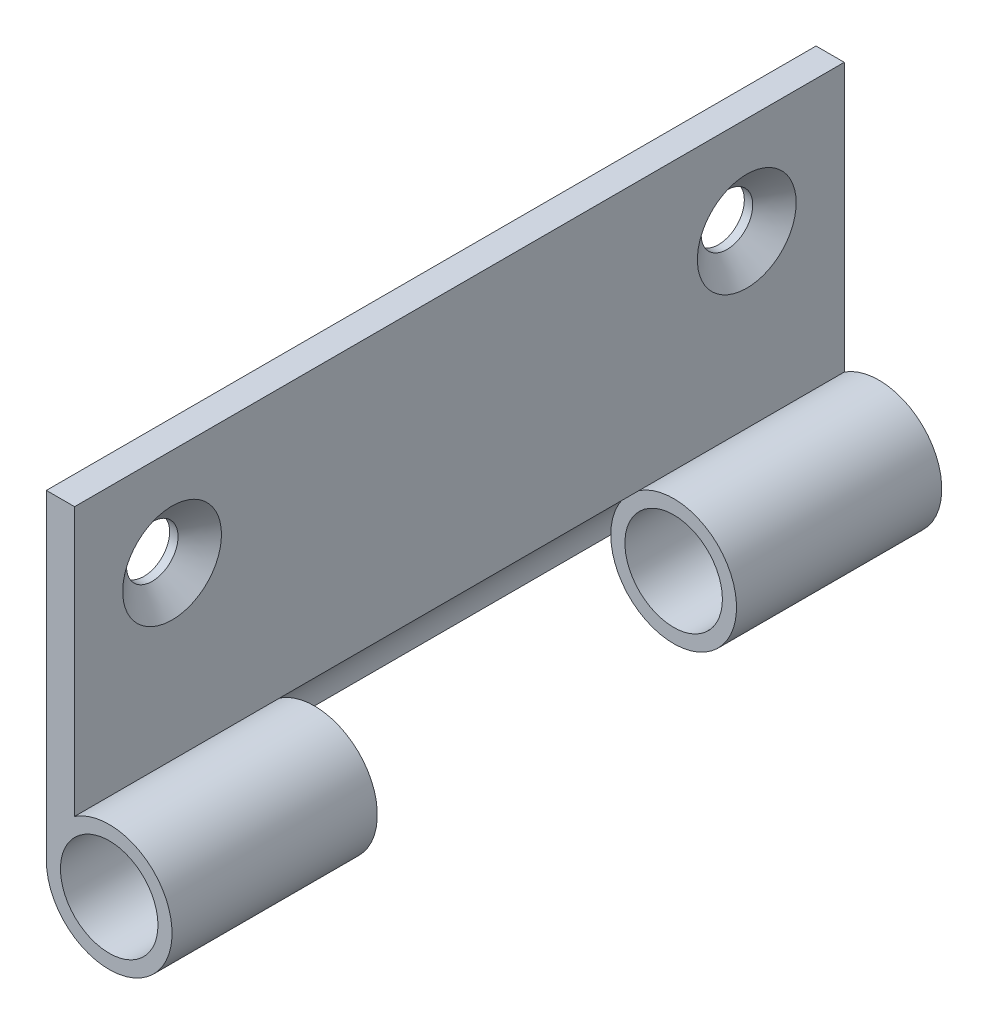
ISO-10303-21;
HEADER;
FILE_DESCRIPTION(('STEP AP214'),'2;1');
FILE_NAME('part.step','',(''),(''),'','','');
FILE_SCHEMA(('AUTOMOTIVE_DESIGN { 1 0 10303 214 1 1 1 1 }'));
ENDSEC;
DATA;
#1=APPLICATION_CONTEXT('core data for automotive mechanical design processes');
#2=APPLICATION_PROTOCOL_DEFINITION('international standard','automotive_design',2000,#1);
#3=PRODUCT_CONTEXT('',#1,'mechanical');
#4=PRODUCT('Part','Part','',(#3));
#5=PRODUCT_RELATED_PRODUCT_CATEGORY('part','',(#4));
#6=PRODUCT_DEFINITION_FORMATION('','',#4);
#7=PRODUCT_DEFINITION_CONTEXT('part definition',#1,'design');
#8=PRODUCT_DEFINITION('design','',#6,#7);
#9=PRODUCT_DEFINITION_SHAPE('','',#8);
#10=(LENGTH_UNIT() NAMED_UNIT(*) SI_UNIT(.MILLI.,.METRE.));
#11=(NAMED_UNIT(*) PLANE_ANGLE_UNIT() SI_UNIT($,.RADIAN.));
#12=(NAMED_UNIT(*) SI_UNIT($,.STERADIAN.) SOLID_ANGLE_UNIT());
#13=UNCERTAINTY_MEASURE_WITH_UNIT(LENGTH_MEASURE(1.E-05),#10,'distance_accuracy_value','');
#14=(GEOMETRIC_REPRESENTATION_CONTEXT(3) GLOBAL_UNCERTAINTY_ASSIGNED_CONTEXT((#13)) GLOBAL_UNIT_ASSIGNED_CONTEXT((#10,
#11,#12)) REPRESENTATION_CONTEXT('',''));
#15=CARTESIAN_POINT('',(0.,0.,0.));
#16=DIRECTION('',(0.,0.,1.));
#17=DIRECTION('',(1.,0.,0.));
#18=AXIS2_PLACEMENT_3D('',#15,#16,#17);
#19=CARTESIAN_POINT('',(6.223,0.,-55.7013019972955));
#20=DIRECTION('',(0.,0.,1.));
#21=DIRECTION('',(1.,0.,0.));
#22=AXIS2_PLACEMENT_3D('',#19,#20,#21);
#23=CYLINDRICAL_SURFACE('',#22,6.223);
#24=DIRECTION('',(0.,0.,1.));
#25=VECTOR('',#24,1.);
#26=CARTESIAN_POINT('',(2.794,5.19304226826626,-55.7013019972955));
#27=LINE('',#26,#25);
#28=CARTESIAN_POINT('',(2.794,5.19304226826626,-17.78));
#29=VERTEX_POINT('',#28);
#30=CARTESIAN_POINT('',(2.794,5.19304226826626,-38.1));
#31=VERTEX_POINT('',#30);
#32=EDGE_CURVE('E64',#29,#31,#27,.F.);
#33=ORIENTED_EDGE('',*,*,#32,.F.);
#34=CARTESIAN_POINT('',(6.223,0.,-17.78));
#35=DIRECTION('',(0.,0.,1.));
#36=DIRECTION('',(1.,0.,0.));
#37=AXIS2_PLACEMENT_3D('',#34,#35,#36);
#38=CIRCLE('',#37,6.223);
#39=CARTESIAN_POINT('',(0.,0.,-17.78));
#40=VERTEX_POINT('',#39);
#41=EDGE_CURVE('E110',#40,#29,#38,.T.);
#42=ORIENTED_EDGE('',*,*,#41,.F.);
#43=DIRECTION('',(0.,0.,-1.));
#44=VECTOR('',#43,1.);
#45=CARTESIAN_POINT('',(0.,0.,38.1));
#46=LINE('',#45,#44);
#47=CARTESIAN_POINT('',(0.,0.,-38.1));
#48=VERTEX_POINT('',#47);
#49=EDGE_CURVE('E120',#40,#48,#46,.T.);
#50=ORIENTED_EDGE('',*,*,#49,.T.);
#51=CARTESIAN_POINT('',(6.223,0.,-38.1));
#52=DIRECTION('',(0.,0.,-1.));
#53=DIRECTION('',(0.,1.,0.));
#54=AXIS2_PLACEMENT_3D('',#51,#52,#53);
#55=CIRCLE('',#54,6.223);
#56=EDGE_CURVE('E147',#48,#31,#55,.F.);
#57=ORIENTED_EDGE('',*,*,#56,.T.);
#58=EDGE_LOOP('',(#33,#42,#50,#57));
#59=FACE_BOUND('',#58,.T.);
#60=ADVANCED_FACE('F40',(#59),#23,.T.);
#61=CARTESIAN_POINT('',(6.223,0.,-38.1));
#62=DIRECTION('',(0.,0.,1.));
#63=DIRECTION('',(1.,0.,0.));
#64=AXIS2_PLACEMENT_3D('',#61,#62,#63);
#65=CYLINDRICAL_SURFACE('',#64,4.826);
#66=CARTESIAN_POINT('',(6.223,0.,-38.1));
#67=DIRECTION('',(0.,0.,1.));
#68=DIRECTION('',(1.,0.,0.));
#69=AXIS2_PLACEMENT_3D('',#66,#67,#68);
#70=CIRCLE('',#69,4.826);
#71=CARTESIAN_POINT('',(11.049,0.,-38.1));
#72=VERTEX_POINT('',#71);
#73=EDGE_CURVE('E150',#72,#72,#70,.T.);
#74=ORIENTED_EDGE('',*,*,#73,.F.);
#75=EDGE_LOOP('',(#74));
#76=FACE_BOUND('',#75,.T.);
#77=CARTESIAN_POINT('',(6.223,0.,-17.78));
#78=DIRECTION('',(0.,0.,1.));
#79=DIRECTION('',(1.,0.,0.));
#80=AXIS2_PLACEMENT_3D('',#77,#78,#79);
#81=CIRCLE('',#80,4.826);
#82=CARTESIAN_POINT('',(11.049,0.,-17.78));
#83=VERTEX_POINT('',#82);
#84=EDGE_CURVE('E44',#83,#83,#81,.F.);
#85=ORIENTED_EDGE('',*,*,#84,.F.);
#86=EDGE_LOOP('',(#85));
#87=FACE_BOUND('',#86,.T.);
#88=ADVANCED_FACE('F217',(#76,#87),#65,.F.);
#89=CARTESIAN_POINT('',(2.794,31.75,38.1));
#90=DIRECTION('',(0.,1.,0.));
#91=DIRECTION('',(0.,0.,1.));
#92=AXIS2_PLACEMENT_3D('',#89,#90,#91);
#93=PLANE('',#92);
#94=DIRECTION('',(0.,0.,-1.));
#95=VECTOR('',#94,1.);
#96=CARTESIAN_POINT('',(0.,31.75,38.1));
#97=LINE('',#96,#95);
#98=CARTESIAN_POINT('',(0.,31.75,38.1));
#99=VERTEX_POINT('',#98);
#100=CARTESIAN_POINT('',(0.,31.75,-38.1));
#101=VERTEX_POINT('',#100);
#102=EDGE_CURVE('E133',#99,#101,#97,.T.);
#103=ORIENTED_EDGE('',*,*,#102,.F.);
#104=DIRECTION('',(-1.,0.,0.));
#105=VECTOR('',#104,1.);
#106=CARTESIAN_POINT('',(2.794,31.75,38.1));
#107=LINE('',#106,#105);
#108=CARTESIAN_POINT('',(2.794,31.75,38.1));
#109=VERTEX_POINT('',#108);
#110=EDGE_CURVE('E12',#109,#99,#107,.T.);
#111=ORIENTED_EDGE('',*,*,#110,.F.);
#112=DIRECTION('',(0.,0.,-1.));
#113=VECTOR('',#112,1.);
#114=CARTESIAN_POINT('',(2.794,31.75,38.1));
#115=LINE('',#114,#113);
#116=CARTESIAN_POINT('',(2.794,31.75,-38.1));
#117=VERTEX_POINT('',#116);
#118=EDGE_CURVE('E126',#109,#117,#115,.T.);
#119=ORIENTED_EDGE('',*,*,#118,.T.);
#120=DIRECTION('',(-1.,0.,0.));
#121=VECTOR('',#120,1.);
#122=CARTESIAN_POINT('',(2.794,31.75,-38.1));
#123=LINE('',#122,#121);
#124=EDGE_CURVE('E49',#117,#101,#123,.T.);
#125=ORIENTED_EDGE('',*,*,#124,.T.);
#126=EDGE_LOOP('',(#103,#111,#119,#125));
#127=FACE_BOUND('',#126,.T.);
#128=ADVANCED_FACE('F42',(#127),#93,.T.);
#129=CARTESIAN_POINT('',(2.794,31.75,38.1));
#130=DIRECTION('',(0.,0.,-1.));
#131=DIRECTION('',(0.,1.,0.));
#132=AXIS2_PLACEMENT_3D('',#129,#130,#131);
#133=PLANE('',#132);
#134=CARTESIAN_POINT('',(6.223,0.,38.1));
#135=DIRECTION('',(0.,0.,1.));
#136=DIRECTION('',(1.,0.,0.));
#137=AXIS2_PLACEMENT_3D('',#134,#135,#136);
#138=CIRCLE('',#137,4.826);
#139=CARTESIAN_POINT('',(11.049,0.,38.1));
#140=VERTEX_POINT('',#139);
#141=EDGE_CURVE('E151',#140,#140,#138,.T.);
#142=ORIENTED_EDGE('',*,*,#141,.F.);
#143=EDGE_LOOP('',(#142));
#144=FACE_BOUND('',#143,.T.);
#145=DIRECTION('',(0.,-1.,0.));
#146=VECTOR('',#145,1.);
#147=CARTESIAN_POINT('',(0.,31.75,38.1));
#148=LINE('',#147,#146);
#149=CARTESIAN_POINT('',(0.,0.,38.1));
#150=VERTEX_POINT('',#149);
#151=EDGE_CURVE('E125',#99,#150,#148,.T.);
#152=ORIENTED_EDGE('',*,*,#151,.T.);
#153=CARTESIAN_POINT('',(6.223,0.,38.1));
#154=DIRECTION('',(0.,0.,1.));
#155=DIRECTION('',(1.,0.,0.));
#156=AXIS2_PLACEMENT_3D('',#153,#154,#155);
#157=CIRCLE('',#156,6.223);
#158=CARTESIAN_POINT('',(2.794,5.19304226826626,38.1));
#159=VERTEX_POINT('',#158);
#160=EDGE_CURVE('E124',#150,#159,#157,.T.);
#161=ORIENTED_EDGE('',*,*,#160,.T.);
#162=DIRECTION('',(0.,-1.,0.));
#163=VECTOR('',#162,1.);
#164=CARTESIAN_POINT('',(2.794,31.75,38.1));
#165=LINE('',#164,#163);
#166=EDGE_CURVE('E140',#109,#159,#165,.T.);
#167=ORIENTED_EDGE('',*,*,#166,.F.);
#168=ORIENTED_EDGE('',*,*,#110,.T.);
#169=EDGE_LOOP('',(#152,#161,#167,#168));
#170=FACE_BOUND('',#169,.T.);
#171=ADVANCED_FACE('F188',(#144,#170),#133,.F.);
#172=CARTESIAN_POINT('',(2.794,31.75,-38.1));
#173=DIRECTION('',(0.,0.,-1.));
#174=DIRECTION('',(0.,1.,0.));
#175=AXIS2_PLACEMENT_3D('',#172,#173,#174);
#176=PLANE('',#175);
#177=ORIENTED_EDGE('',*,*,#73,.T.);
#178=EDGE_LOOP('',(#177));
#179=FACE_BOUND('',#178,.T.);
#180=ORIENTED_EDGE('',*,*,#56,.F.);
#181=DIRECTION('',(0.,-1.,0.));
#182=VECTOR('',#181,1.);
#183=CARTESIAN_POINT('',(0.,31.75,-38.1));
#184=LINE('',#183,#182);
#185=EDGE_CURVE('E129',#101,#48,#184,.T.);
#186=ORIENTED_EDGE('',*,*,#185,.F.);
#187=ORIENTED_EDGE('',*,*,#124,.F.);
#188=DIRECTION('',(0.,-1.,0.));
#189=VECTOR('',#188,1.);
#190=CARTESIAN_POINT('',(2.794,31.75,-38.1));
#191=LINE('',#190,#189);
#192=EDGE_CURVE('E142',#117,#31,#191,.T.);
#193=ORIENTED_EDGE('',*,*,#192,.T.);
#194=EDGE_LOOP('',(#180,#186,#187,#193));
#195=FACE_BOUND('',#194,.T.);
#196=ADVANCED_FACE('F182',(#179,#195),#176,.T.);
#197=CARTESIAN_POINT('',(2.794,0.,0.));
#198=DIRECTION('',(-1.,0.,0.));
#199=DIRECTION('',(0.,0.,1.));
#200=AXIS2_PLACEMENT_3D('',#197,#198,#199);
#201=PLANE('',#200);
#202=CARTESIAN_POINT('',(2.794,22.098,-28.448));
#203=DIRECTION('',(1.,0.,0.));
#204=DIRECTION('',(0.,0.,-1.));
#205=AXIS2_PLACEMENT_3D('',#202,#203,#204);
#206=CIRCLE('',#205,4.8895);
#207=CARTESIAN_POINT('',(2.794,22.098,-33.3375));
#208=VERTEX_POINT('',#207);
#209=EDGE_CURVE('E173',#208,#208,#206,.T.);
#210=ORIENTED_EDGE('',*,*,#209,.F.);
#211=EDGE_LOOP('',(#210));
#212=FACE_BOUND('',#211,.T.);
#213=CARTESIAN_POINT('',(2.794,22.098,28.448));
#214=DIRECTION('',(1.,0.,0.));
#215=DIRECTION('',(0.,0.,-1.));
#216=AXIS2_PLACEMENT_3D('',#213,#214,#215);
#217=CIRCLE('',#216,4.8895);
#218=CARTESIAN_POINT('',(2.794,22.098,23.5585));
#219=VERTEX_POINT('',#218);
#220=EDGE_CURVE('E164',#219,#219,#217,.T.);
#221=ORIENTED_EDGE('',*,*,#220,.F.);
#222=EDGE_LOOP('',(#221));
#223=FACE_BOUND('',#222,.T.);
#224=ORIENTED_EDGE('',*,*,#166,.T.);
#225=CARTESIAN_POINT('',(2.794,5.19304226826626,17.78));
#226=VERTEX_POINT('',#225);
#227=EDGE_CURVE('E137',#159,#226,#27,.F.);
#228=ORIENTED_EDGE('',*,*,#227,.T.);
#229=EDGE_CURVE('E109',#226,#29,#27,.F.);
#230=ORIENTED_EDGE('',*,*,#229,.T.);
#231=ORIENTED_EDGE('',*,*,#32,.T.);
#232=ORIENTED_EDGE('',*,*,#192,.F.);
#233=ORIENTED_EDGE('',*,*,#118,.F.);
#234=EDGE_LOOP('',(#224,#228,#230,#231,#232,#233));
#235=FACE_BOUND('',#234,.T.);
#236=ADVANCED_FACE('F179',(#212,#223,#235),#201,.F.);
#237=CARTESIAN_POINT('',(0.,0.,0.));
#238=DIRECTION('',(-1.,0.,0.));
#239=DIRECTION('',(0.,0.,1.));
#240=AXIS2_PLACEMENT_3D('',#237,#238,#239);
#241=PLANE('',#240);
#242=CARTESIAN_POINT('',(0.,22.098,-28.448));
#243=DIRECTION('',(1.,0.,0.));
#244=DIRECTION('',(0.,0.,-1.));
#245=AXIS2_PLACEMENT_3D('',#242,#243,#244);
#246=CIRCLE('',#245,2.5527);
#247=CARTESIAN_POINT('',(0.,22.098,-31.0007));
#248=VERTEX_POINT('',#247);
#249=EDGE_CURVE('E167',#248,#248,#246,.T.);
#250=ORIENTED_EDGE('',*,*,#249,.T.);
#251=EDGE_LOOP('',(#250));
#252=FACE_BOUND('',#251,.T.);
#253=CARTESIAN_POINT('',(0.,22.098,28.448));
#254=DIRECTION('',(1.,0.,0.));
#255=DIRECTION('',(0.,0.,-1.));
#256=AXIS2_PLACEMENT_3D('',#253,#254,#255);
#257=CIRCLE('',#256,2.5527);
#258=CARTESIAN_POINT('',(0.,22.098,25.8953));
#259=VERTEX_POINT('',#258);
#260=EDGE_CURVE('E101',#259,#259,#257,.T.);
#261=ORIENTED_EDGE('',*,*,#260,.T.);
#262=EDGE_LOOP('',(#261));
#263=FACE_BOUND('',#262,.T.);
#264=ORIENTED_EDGE('',*,*,#102,.T.);
#265=ORIENTED_EDGE('',*,*,#185,.T.);
#266=ORIENTED_EDGE('',*,*,#49,.F.);
#267=CARTESIAN_POINT('',(0.,0.,17.78));
#268=VERTEX_POINT('',#267);
#269=EDGE_CURVE('E107',#268,#40,#46,.T.);
#270=ORIENTED_EDGE('',*,*,#269,.F.);
#271=EDGE_CURVE('E117',#150,#268,#46,.T.);
#272=ORIENTED_EDGE('',*,*,#271,.F.);
#273=ORIENTED_EDGE('',*,*,#151,.F.);
#274=EDGE_LOOP('',(#264,#265,#266,#270,#272,#273));
#275=FACE_BOUND('',#274,.T.);
#276=ADVANCED_FACE('F115',(#252,#263,#275),#241,.T.);
#277=CARTESIAN_POINT('',(6.223,0.,17.78));
#278=DIRECTION('',(0.,0.,1.));
#279=DIRECTION('',(1.,0.,0.));
#280=AXIS2_PLACEMENT_3D('',#277,#278,#279);
#281=CIRCLE('',#280,6.223);
#282=EDGE_CURVE('E94',#268,#226,#281,.T.);
#283=ORIENTED_EDGE('',*,*,#282,.T.);
#284=ORIENTED_EDGE('',*,*,#227,.F.);
#285=ORIENTED_EDGE('',*,*,#160,.F.);
#286=ORIENTED_EDGE('',*,*,#271,.T.);
#287=EDGE_LOOP('',(#283,#284,#285,#286));
#288=FACE_BOUND('',#287,.T.);
#289=ADVANCED_FACE('F122',(#288),#23,.T.);
#290=CARTESIAN_POINT('',(6.223,0.,17.78));
#291=DIRECTION('',(0.,0.,1.));
#292=DIRECTION('',(1.,0.,0.));
#293=AXIS2_PLACEMENT_3D('',#290,#291,#292);
#294=CIRCLE('',#293,4.826);
#295=CARTESIAN_POINT('',(11.049,0.,17.78));
#296=VERTEX_POINT('',#295);
#297=EDGE_CURVE('E158',#296,#296,#294,.F.);
#298=ORIENTED_EDGE('',*,*,#297,.T.);
#299=EDGE_LOOP('',(#298));
#300=FACE_BOUND('',#299,.T.);
#301=ORIENTED_EDGE('',*,*,#141,.T.);
#302=EDGE_LOOP('',(#301));
#303=FACE_BOUND('',#302,.T.);
#304=ADVANCED_FACE('F204',(#300,#303),#65,.F.);
#305=CARTESIAN_POINT('',(6.223,0.,-17.78));
#306=DIRECTION('',(0.,0.,1.));
#307=DIRECTION('',(1.,0.,0.));
#308=AXIS2_PLACEMENT_3D('',#305,#306,#307);
#309=CYLINDRICAL_SURFACE('',#308,6.223);
#310=EDGE_CURVE('E56',#226,#268,#281,.T.);
#311=ORIENTED_EDGE('',*,*,#310,.T.);
#312=ORIENTED_EDGE('',*,*,#269,.T.);
#313=EDGE_CURVE('E156',#29,#40,#38,.T.);
#314=ORIENTED_EDGE('',*,*,#313,.F.);
#315=ORIENTED_EDGE('',*,*,#229,.F.);
#316=EDGE_LOOP('',(#311,#312,#314,#315));
#317=FACE_BOUND('',#316,.T.);
#318=ADVANCED_FACE('F105',(#317),#309,.F.);
#319=CARTESIAN_POINT('',(6.223,0.,-17.78));
#320=DIRECTION('',(0.,0.,1.));
#321=DIRECTION('',(1.,0.,0.));
#322=AXIS2_PLACEMENT_3D('',#319,#320,#321);
#323=PLANE('',#322);
#324=ORIENTED_EDGE('',*,*,#313,.T.);
#325=ORIENTED_EDGE('',*,*,#41,.T.);
#326=EDGE_LOOP('',(#324,#325));
#327=FACE_BOUND('',#326,.T.);
#328=ORIENTED_EDGE('',*,*,#84,.T.);
#329=EDGE_LOOP('',(#328));
#330=FACE_BOUND('',#329,.T.);
#331=ADVANCED_FACE('F194',(#327,#330),#323,.T.);
#332=CARTESIAN_POINT('',(6.223,0.,17.78));
#333=DIRECTION('',(0.,0.,1.));
#334=DIRECTION('',(1.,0.,0.));
#335=AXIS2_PLACEMENT_3D('',#332,#333,#334);
#336=PLANE('',#335);
#337=ORIENTED_EDGE('',*,*,#310,.F.);
#338=ORIENTED_EDGE('',*,*,#282,.F.);
#339=EDGE_LOOP('',(#337,#338));
#340=FACE_BOUND('',#339,.T.);
#341=ORIENTED_EDGE('',*,*,#297,.F.);
#342=EDGE_LOOP('',(#341));
#343=FACE_BOUND('',#342,.T.);
#344=ADVANCED_FACE('F95',(#340,#343),#336,.F.);
#345=CARTESIAN_POINT('',(2.794,22.098,28.448));
#346=DIRECTION('',(1.,0.,0.));
#347=DIRECTION('',(0.,0.,-1.));
#348=AXIS2_PLACEMENT_3D('',#345,#346,#347);
#349=CYLINDRICAL_SURFACE('',#348,2.55269999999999);
#350=ORIENTED_EDGE('',*,*,#260,.F.);
#351=EDGE_LOOP('',(#350));
#352=FACE_BOUND('',#351,.T.);
#353=CARTESIAN_POINT('',(0.833191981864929,22.098,28.448));
#354=DIRECTION('',(1.,0.,0.));
#355=DIRECTION('',(0.,0.,-1.));
#356=AXIS2_PLACEMENT_3D('',#353,#354,#355);
#357=CIRCLE('',#356,2.55269999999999);
#358=CARTESIAN_POINT('',(0.833191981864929,22.098,25.8953));
#359=VERTEX_POINT('',#358);
#360=EDGE_CURVE('E161',#359,#359,#357,.T.);
#361=ORIENTED_EDGE('',*,*,#360,.T.);
#362=EDGE_LOOP('',(#361));
#363=FACE_BOUND('',#362,.T.);
#364=ADVANCED_FACE('F207',(#352,#363),#349,.F.);
#365=CARTESIAN_POINT('',(2.794,22.098,28.448));
#366=DIRECTION('',(1.,0.,0.));
#367=DIRECTION('',(0.,0.,-1.));
#368=AXIS2_PLACEMENT_3D('',#365,#366,#367);
#369=CONICAL_SURFACE('',#368,4.8895,0.872664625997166);
#370=ORIENTED_EDGE('',*,*,#360,.F.);
#371=EDGE_LOOP('',(#370));
#372=FACE_BOUND('',#371,.T.);
#373=ORIENTED_EDGE('',*,*,#220,.T.);
#374=EDGE_LOOP('',(#373));
#375=FACE_BOUND('',#374,.T.);
#376=ADVANCED_FACE('F212',(#372,#375),#369,.F.);
#377=CARTESIAN_POINT('',(2.794,22.098,-28.448));
#378=DIRECTION('',(1.,0.,0.));
#379=DIRECTION('',(0.,0.,-1.));
#380=AXIS2_PLACEMENT_3D('',#377,#378,#379);
#381=CYLINDRICAL_SURFACE('',#380,2.55269999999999);
#382=ORIENTED_EDGE('',*,*,#249,.F.);
#383=EDGE_LOOP('',(#382));
#384=FACE_BOUND('',#383,.T.);
#385=CARTESIAN_POINT('',(0.833191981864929,22.098,-28.448));
#386=DIRECTION('',(1.,0.,0.));
#387=DIRECTION('',(0.,0.,-1.));
#388=AXIS2_PLACEMENT_3D('',#385,#386,#387);
#389=CIRCLE('',#388,2.55269999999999);
#390=CARTESIAN_POINT('',(0.833191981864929,22.098,-31.0007));
#391=VERTEX_POINT('',#390);
#392=EDGE_CURVE('E170',#391,#391,#389,.T.);
#393=ORIENTED_EDGE('',*,*,#392,.T.);
#394=EDGE_LOOP('',(#393));
#395=FACE_BOUND('',#394,.T.);
#396=ADVANCED_FACE('F273',(#384,#395),#381,.F.);
#397=CARTESIAN_POINT('',(2.794,22.098,-28.448));
#398=DIRECTION('',(1.,0.,0.));
#399=DIRECTION('',(0.,0.,-1.));
#400=AXIS2_PLACEMENT_3D('',#397,#398,#399);
#401=CONICAL_SURFACE('',#400,4.8895,0.872664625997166);
#402=ORIENTED_EDGE('',*,*,#392,.F.);
#403=EDGE_LOOP('',(#402));
#404=FACE_BOUND('',#403,.T.);
#405=ORIENTED_EDGE('',*,*,#209,.T.);
#406=EDGE_LOOP('',(#405));
#407=FACE_BOUND('',#406,.T.);
#408=ADVANCED_FACE('F177',(#404,#407),#401,.F.);
#409=CLOSED_SHELL('',(#60,#88,#128,#171,#196,#236,#276,#289,#304,#318,#331,#344,#364,#376,#396,#408));
#410=MANIFOLD_SOLID_BREP('B2',#409);
#411=ADVANCED_BREP_SHAPE_REPRESENTATION('',(#18,#410),#14);
#412=SHAPE_DEFINITION_REPRESENTATION(#9,#411);
ENDSEC;
END-ISO-10303-21;
